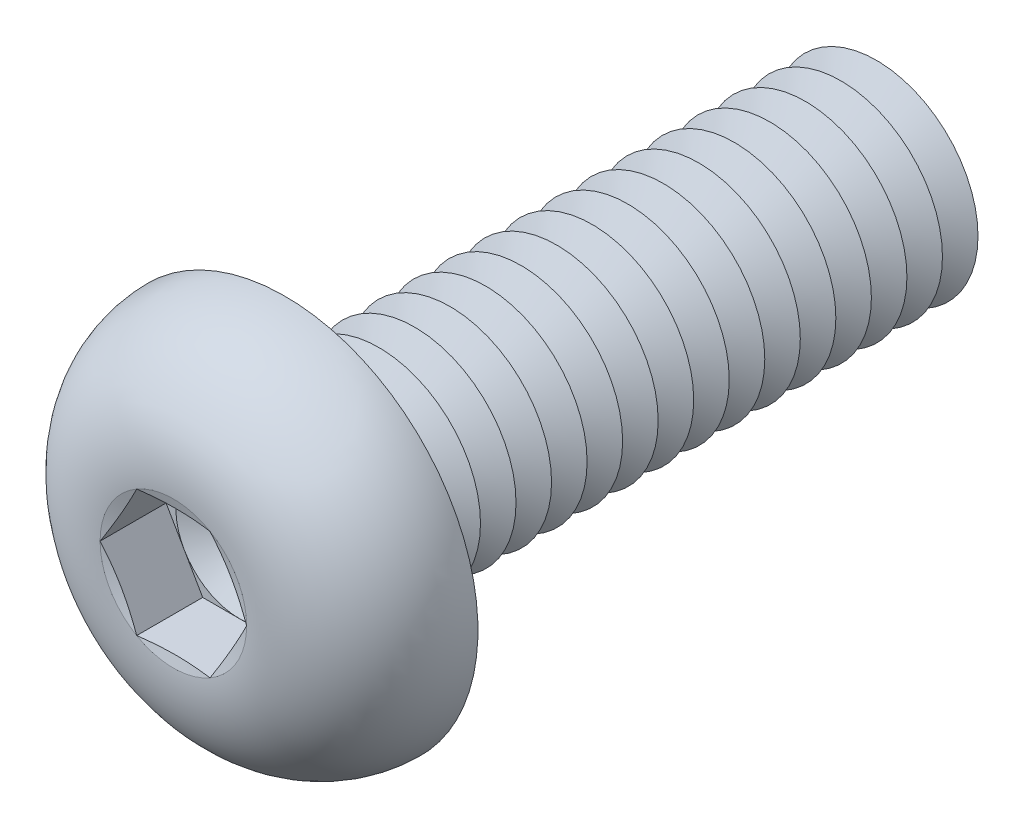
from build123d import *

# Parameters (mm, degrees)
FILLET1_R          = 0.35
LPATTERN1_COUNT    = 17
LPATTERN1_PITCH    = 0.7
CUT_EXTRUDE1_DEPTH = 1.3


with BuildPart() as part:
    # Sketch1 → Revolve1 (revolve)
    with BuildSketch(Plane(origin=(0, 0, 0), x_dir=(0, 0, -1), z_dir=(1, 0, 0)), mode=Mode.PRIVATE) as revolve1_sk:
        with BuildLine():
            Line((0, 2), (0, 3.8))
            ThreePointArc((0, 3.8), (-1.611961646, 3.099623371), (-2.2, 1.443375))
            Line((-2.2, 1.443375), (-2.006624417, 0.7216875))
            Line((-2.006624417, 0.7216875), (-2.2, 0.7216875))
            Line((-2.2, 0.7216875), (-2.2, 0))
            Line((-2.2, 0), (12, 0))
            Line((12, 0), (12, 2))
            Line((12, 2), (0, 2))
        make_face()
    revolve(revolve1_sk.sketch.rotate(Axis((0, 0, -12), (0, 0, 1)), 90), axis=Axis((0, 0, -12), (0, 0, 1)))

    # Fillet1
    fillet1_edges = [part.edges().sort_by_distance(p)[0] for p in [
        (2, 0, 0),
    ]]
    fillet(fillet1_edges, radius=FILLET1_R)

    # Sketch2 → Cut-Revolve1 (revolve, cut)
    with BuildSketch(Plane(origin=(0, 0, 0), x_dir=(0, 0, -1), z_dir=(1, 0, 0)), mode=Mode.PRIVATE) as cut_revolve1_sk:
        Polygon((11.65, 2), (12.35, 2), (12, 1.393782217), align=None)
    cut_revolve1 = revolve(cut_revolve1_sk.sketch.rotate(Axis((0, 0, -12), (0, 0, -1)), 270), axis=Axis((0, 0, -12), (0, 0, -1)), mode=Mode.SUBTRACT)

    # LPattern1: Cut-Revolve1 ×17
    with Locations(*[(0, 0, i * LPATTERN1_PITCH) for i in range(1, LPATTERN1_COUNT)]):
        add(cut_revolve1, mode=Mode.SUBTRACT)

    # Sketch3 → Cut-Extrude1 (cut)
    with BuildSketch(Plane.XY.offset(2.2)):
        Polygon((0.7216875, 1.249999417), (-0.7216875, 1.249999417), (-1.443375, 0), (-0.7216875, -1.249999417), (0.7216875, -1.249999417), (1.443375, 0), align=None)
    extrude(amount=-CUT_EXTRUDE1_DEPTH, mode=Mode.SUBTRACT)

    # Cut-Extrude2 cone 1 section (on through the dimple's axis) → Cut-Extrude2 (revolve, cut)
    with BuildSketch(Plane(origin=(0, 0, 0.9), x_dir=(0, -1, 0), z_dir=(1, 0, 0))):
        Polygon((0, 0), (1.249999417, 0), (0, 0.7216875), align=None)
    revolve(axis=Axis((0, 0, 0.9), (0, 0, -1)), mode=Mode.SUBTRACT)


solid = part.part
